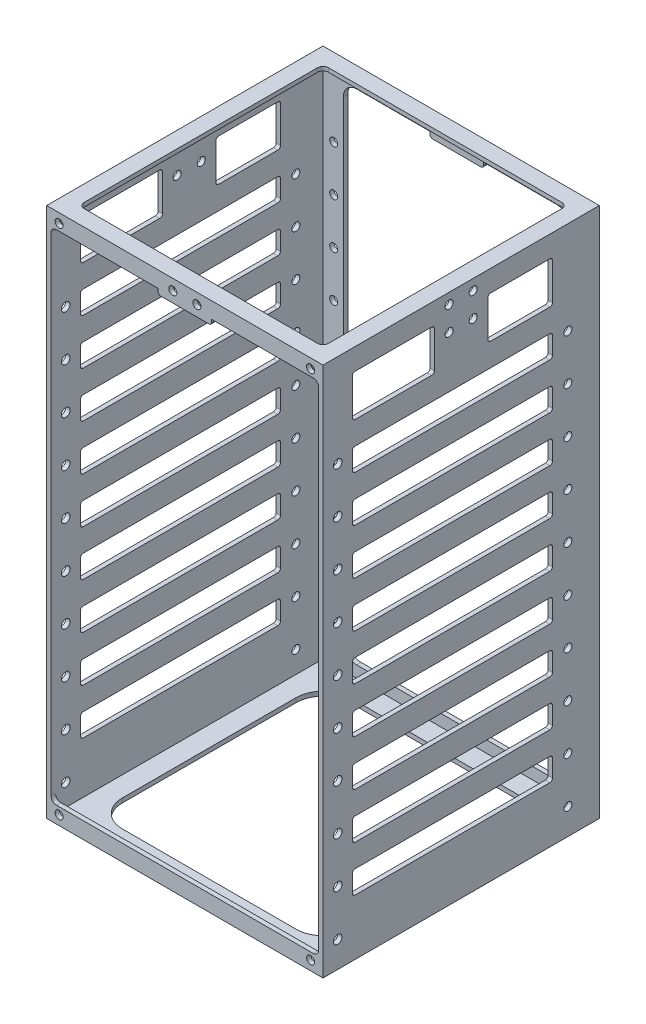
from build123d import *

# Parameters (mm, degrees)
SKETCH1_W           = 103.26
SKETCH1_H           = 103.26
BOSS_EXTRUDE2_DEPTH = 1.63
SKETCH3_W           = 103.26
SKETCH3_H           = 103.26
SKETCH3_W_2         = 100
SKETCH3_H_2         = 100
BOSS_EXTRUDE3_DEPTH = 196.74
CUT_EXTRUDE1_DEPTH  = 1.63
SKETCH6_R           = 1.6
SKETCH6_R_2         = 1.5
CUT_EXTRUDE2_DEPTH  = 230.518934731
CUT_EXTRUDE3_DEPTH  = 1.63
CUT_EXTRUDE4_DEPTH  = 230.518934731
CUT_EXTRUDE5_DEPTH  = 230.518934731
SKETCH15_W          = 20
SKETCH15_H          = 15.62
BOSS_EXTRUDE4_DEPTH = 1.63
SKETCH16_W          = 20
SKETCH16_H          = 15.62
BOSS_EXTRUDE5_DEPTH = 1.63
SKETCH9_R           = 1.5
CUT_EXTRUDE6_DEPTH  = 230.518934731
FILLET1_R           = 1
BOSS_EXTRUDE7_DEPTH = 1.63
BOSS_EXTRUDE6_START = -1.63
BOSS_EXTRUDE6_DEPTH = 1.63
SKETCH19_R          = 1.5
CUT_EXTRUDE7_DEPTH  = 230.518934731
SKETCH20_R          = 1.5
CUT_EXTRUDE8_DEPTH  = 1.63
SKETCH23_R          = 1.5
CUT_EXTRUDE10_DEPTH = 1.63
SKETCH25_W          = 100
SKETCH25_H          = 100
BOSS_EXTRUDE8_DEPTH = 1.5
CUT_EXTRUDE11_DEPTH = 1.5


with BuildPart() as part:
    # Sketch1 → Boss-Extrude2 (new body)
    with BuildSketch(Plane(origin=(0, 0, 0), x_dir=(1, 0, 0), z_dir=(0, 1, 0))):
        Rectangle(SKETCH1_W, SKETCH1_H)
        with BuildLine():
            Line((-32.5, -42.5), (32.5, -42.5))
            ThreePointArc((32.5, -42.5), (39.571067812, -39.571067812), (42.5, -32.5))
            Line((42.5, -32.5), (42.5, 32.5))
            ThreePointArc((42.5, 32.5), (39.571067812, 39.571067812), (32.5, 42.5))
            Line((32.5, 42.5), (-32.5, 42.5))
            ThreePointArc((-32.5, 42.5), (-39.571067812, 39.571067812), (-42.5, 32.5))
            Line((-42.5, 32.5), (-42.5, -32.5))
            ThreePointArc((-42.5, -32.5), (-39.571067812, -39.571067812), (-32.5, -42.5))
        make_face(mode=Mode.SUBTRACT)
    extrude(amount=BOSS_EXTRUDE2_DEPTH)

    # Sketch3 → Boss-Extrude3 (add)
    with BuildSketch(Plane(origin=(0, 1.63, 0), x_dir=(1, 0, 0), z_dir=(0, 1, 0))):
        Rectangle(SKETCH3_W, SKETCH3_H)
        Rectangle(SKETCH3_W_2, SKETCH3_H_2, mode=Mode.SUBTRACT)
    extrude(amount=BOSS_EXTRUDE3_DEPTH)

    # Sketch4 → Cut-Extrude1 (cut)
    with BuildSketch(Plane.XY.offset(-51.63)):
        with BuildLine():
            Line((-37.38, 6), (37.38, 6))
            ThreePointArc((37.38, 6), (40.915533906, 7.464466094), (42.38, 11))
            Line((42.38, 11), (42.38, 187.37))
            ThreePointArc((42.38, 187.37), (40.915533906, 190.905533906), (37.38, 192.37))
            Line((37.38, 192.37), (-37.38, 192.37))
            ThreePointArc((-37.38, 192.37), (-40.915533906, 190.905533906), (-42.38, 187.37))
            Line((-42.38, 187.37), (-42.38, 11))
            ThreePointArc((-42.38, 11), (-40.915533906, 7.464466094), (-37.38, 6))
        make_face()
    extrude(amount=CUT_EXTRUDE1_DEPTH, mode=Mode.SUBTRACT)

    # Sketch6 → Cut-Extrude2 (cut, through all)
    with BuildSketch(Plane(origin=(51.63, 0, 0), x_dir=(0, 0, -1), z_dir=(1, 0, 0))):
        with Locations((-46.13, 9.75)):
            Circle(SKETCH6_R)
        with Locations((39.87, 9.75)):
            Circle(SKETCH6_R_2)
        with Locations((-46.13, 26.85)):
            Circle(SKETCH6_R)
        with Locations((39.87, 26.85)):
            Circle(SKETCH6_R_2)
        with Locations((-46.13, 43.95)):
            Circle(SKETCH6_R)
        with Locations((39.87, 43.95)):
            Circle(SKETCH6_R_2)
        with Locations((-46.13, 61.05)):
            Circle(SKETCH6_R)
        with Locations((39.87, 61.05)):
            Circle(SKETCH6_R_2)
        with Locations((-46.13, 78.15)):
            Circle(SKETCH6_R)
        with Locations((39.87, 78.15)):
            Circle(SKETCH6_R_2)
        with Locations((-46.13, 95.25)):
            Circle(SKETCH6_R)
        with Locations((39.87, 95.25)):
            Circle(SKETCH6_R_2)
        with Locations((-46.13, 112.35)):
            Circle(SKETCH6_R)
        with Locations((39.87, 112.35)):
            Circle(SKETCH6_R_2)
        with Locations((-46.13, 129.45)):
            Circle(SKETCH6_R)
        with Locations((39.87, 129.45)):
            Circle(SKETCH6_R_2)
        with Locations((-46.13, 146.55)):
            Circle(SKETCH6_R)
        with Locations((39.87, 146.55)):
            Circle(SKETCH6_R_2)
        with Locations((-46.13, 163.65)):
            Circle(SKETCH6_R)
        with Locations((39.87, 163.65)):
            Circle(SKETCH6_R_2)
    extrude(amount=-CUT_EXTRUDE2_DEPTH, mode=Mode.SUBTRACT)

    # Sketch5 → Cut-Extrude3 (cut)
    with BuildSketch(Plane.XY.offset(51.63)):
        with BuildLine():
            Line((-48, 6.13), (48, 6.13))
            ThreePointArc((48, 6.13), (49.414213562, 6.715786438), (50, 8.13))
            Line((50, 8.13), (50, 190.37))
            ThreePointArc((50, 190.37), (49.414213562, 191.784213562), (48, 192.37))
            Line((48, 192.37), (-48, 192.37))
            ThreePointArc((-48, 192.37), (-49.414213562, 191.784213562), (-50, 190.37))
            Line((-50, 190.37), (-50, 8.13))
            ThreePointArc((-50, 8.13), (-49.414213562, 6.715786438), (-48, 6.13))
        make_face()
    extrude(amount=-CUT_EXTRUDE3_DEPTH, mode=Mode.SUBTRACT)

    # Sketch7 → Cut-Extrude4 (cut, through all)
    with BuildSketch(Plane(origin=(51.63, 0, 0), x_dir=(0, 0, -1), z_dir=(1, 0, 0))):
        with BuildLine():
            Line((-40.63, 38.95), (-40.63, 45.45))
            ThreePointArc((-40.63, 45.45), (-40.337106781, 46.157106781), (-39.63, 46.45))
            Line((-39.63, 46.45), (33.12, 46.45))
            ThreePointArc((33.12, 46.45), (33.827106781, 46.157106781), (34.12, 45.45))
            Line((34.12, 45.45), (34.12, 38.95))
            ThreePointArc((34.12, 38.95), (33.827106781, 38.242893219), (33.12, 37.95))
            Line((33.12, 37.95), (-39.63, 37.95))
            ThreePointArc((-39.63, 37.95), (-40.337106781, 38.242893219), (-40.63, 38.95))
        make_face()
        with BuildLine():
            Line((-39.63, 20.85), (33.12, 20.85))
            ThreePointArc((33.12, 20.85), (33.827106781, 21.142893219), (34.12, 21.85))
            Line((34.12, 21.85), (34.12, 28.35))
            ThreePointArc((34.12, 28.35), (33.827106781, 29.057106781), (33.12, 29.35))
            Line((33.12, 29.35), (-39.63, 29.35))
            ThreePointArc((-39.63, 29.35), (-40.337106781, 29.057106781), (-40.63, 28.35))
            Line((-40.63, 28.35), (-40.63, 21.85))
            ThreePointArc((-40.63, 21.85), (-40.337106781, 21.142893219), (-39.63, 20.85))
        make_face()
        with BuildLine():
            Line((-40.63, 158.65), (-40.63, 165.15))
            ThreePointArc((-40.63, 165.15), (-40.337106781, 165.857106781), (-39.63, 166.15))
            Line((-39.63, 166.15), (33.12, 166.15))
            ThreePointArc((33.12, 166.15), (33.827106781, 165.857106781), (34.12, 165.15))
            Line((34.12, 165.15), (34.12, 158.65))
            ThreePointArc((34.12, 158.65), (33.827106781, 157.942893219), (33.12, 157.65))
            Line((33.12, 157.65), (-39.63, 157.65))
            ThreePointArc((-39.63, 157.65), (-40.337106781, 157.942893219), (-40.63, 158.65))
        make_face()
        with BuildLine():
            Line((-40.63, 56.05), (-40.63, 62.55))
            ThreePointArc((-40.63, 62.55), (-40.337106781, 63.257106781), (-39.63, 63.55))
            Line((-39.63, 63.55), (33.12, 63.55))
            ThreePointArc((33.12, 63.55), (33.827106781, 63.257106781), (34.12, 62.55))
            Line((34.12, 62.55), (34.12, 56.05))
            ThreePointArc((34.12, 56.05), (33.827106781, 55.342893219), (33.12, 55.05))
            Line((33.12, 55.05), (-39.63, 55.05))
            ThreePointArc((-39.63, 55.05), (-40.337106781, 55.342893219), (-40.63, 56.05))
        make_face()
        with BuildLine():
            Line((-40.63, 73.15), (-40.63, 79.65))
            ThreePointArc((-40.63, 79.65), (-40.337106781, 80.357106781), (-39.63, 80.65))
            Line((-39.63, 80.65), (33.12, 80.65))
            ThreePointArc((33.12, 80.65), (33.827106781, 80.357106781), (34.12, 79.65))
            Line((34.12, 79.65), (34.12, 73.15))
            ThreePointArc((34.12, 73.15), (33.827106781, 72.442893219), (33.12, 72.15))
            Line((33.12, 72.15), (-39.63, 72.15))
            ThreePointArc((-39.63, 72.15), (-40.337106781, 72.442893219), (-40.63, 73.15))
        make_face()
        with BuildLine():
            Line((-40.63, 90.25), (-40.63, 96.75))
            ThreePointArc((-40.63, 96.75), (-40.337106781, 97.457106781), (-39.63, 97.75))
            Line((-39.63, 97.75), (33.12, 97.75))
            ThreePointArc((33.12, 97.75), (33.827106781, 97.457106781), (34.12, 96.75))
            Line((34.12, 96.75), (34.12, 90.25))
            ThreePointArc((34.12, 90.25), (33.827106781, 89.542893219), (33.12, 89.25))
            Line((33.12, 89.25), (-39.63, 89.25))
            ThreePointArc((-39.63, 89.25), (-40.337106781, 89.542893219), (-40.63, 90.25))
        make_face()
        with BuildLine():
            Line((-40.63, 107.35), (-40.63, 113.85))
            ThreePointArc((-40.63, 113.85), (-40.337106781, 114.557106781), (-39.63, 114.85))
            Line((-39.63, 114.85), (33.12, 114.85))
            ThreePointArc((33.12, 114.85), (33.827106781, 114.557106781), (34.12, 113.85))
            Line((34.12, 113.85), (34.12, 107.35))
            ThreePointArc((34.12, 107.35), (33.827106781, 106.642893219), (33.12, 106.35))
            Line((33.12, 106.35), (-39.63, 106.35))
            ThreePointArc((-39.63, 106.35), (-40.337106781, 106.642893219), (-40.63, 107.35))
        make_face()
        with BuildLine():
            Line((-40.63, 124.45), (-40.63, 130.95))
            ThreePointArc((-40.63, 130.95), (-40.337106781, 131.657106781), (-39.63, 131.95))
            Line((-39.63, 131.95), (33.12, 131.95))
            ThreePointArc((33.12, 131.95), (33.827106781, 131.657106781), (34.12, 130.95))
            Line((34.12, 130.95), (34.12, 124.45))
            ThreePointArc((34.12, 124.45), (33.827106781, 123.742893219), (33.12, 123.45))
            Line((33.12, 123.45), (-39.63, 123.45))
            ThreePointArc((-39.63, 123.45), (-40.337106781, 123.742893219), (-40.63, 124.45))
        make_face()
        with BuildLine():
            Line((-40.63, 141.55), (-40.63, 148.05))
            ThreePointArc((-40.63, 148.05), (-40.337106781, 148.757106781), (-39.63, 149.05))
            Line((-39.63, 149.05), (33.12, 149.05))
            ThreePointArc((33.12, 149.05), (33.827106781, 148.757106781), (34.12, 148.05))
            Line((34.12, 148.05), (34.12, 141.55))
            ThreePointArc((34.12, 141.55), (33.827106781, 140.842893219), (33.12, 140.55))
            Line((33.12, 140.55), (-39.63, 140.55))
            ThreePointArc((-39.63, 140.55), (-40.337106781, 140.842893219), (-40.63, 141.55))
        make_face()
    extrude(amount=-CUT_EXTRUDE4_DEPTH, mode=Mode.SUBTRACT)

    # Sketch8 → Cut-Extrude5 (cut, through all)
    with BuildSketch(Plane(origin=(51.63, 0, 0), x_dir=(0, 0, -1), z_dir=(1, 0, 0))):
        with BuildLine():
            Line((-39.63, 190.37), (33.12, 190.37))
            ThreePointArc((33.12, 190.37), (33.827106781, 190.077106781), (34.12, 189.37))
            Line((34.12, 189.37), (34.12, 175.75))
            ThreePointArc((34.12, 175.75), (33.827106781, 175.042893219), (33.12, 174.75))
            Line((33.12, 174.75), (-39.63, 174.75))
            ThreePointArc((-39.63, 174.75), (-40.337106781, 175.042893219), (-40.63, 175.75))
            Line((-40.63, 175.75), (-40.63, 189.37))
            ThreePointArc((-40.63, 189.37), (-40.337106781, 190.077106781), (-39.63, 190.37))
        make_face()
    extrude(amount=-CUT_EXTRUDE5_DEPTH, mode=Mode.SUBTRACT)

    # Sketch15 → Boss-Extrude4 (add)
    with BuildSketch(Plane(origin=(51.63, 0, 0), x_dir=(0, 0, -1), z_dir=(1, 0, 0))):
        with Locations((0, 182.56)):
            Rectangle(SKETCH15_W, SKETCH15_H)
    extrude(amount=-BOSS_EXTRUDE4_DEPTH)

    # Sketch16 → Boss-Extrude5 (add)
    with BuildSketch(Plane.ZY.offset(51.63)):
        with Locations((0, 182.56)):
            Rectangle(SKETCH16_W, SKETCH16_H)
    extrude(amount=-BOSS_EXTRUDE5_DEPTH)

    # Sketch9 → Cut-Extrude6 (cut, through all)
    with BuildSketch(Plane(origin=(51.63, 0, 0), x_dir=(0, 0, -1), z_dir=(1, 0, 0))):
        with Locations((-4.5, 194.37)):
            Circle(SKETCH9_R)
        with Locations((4.5, 194.37)):
            Circle(SKETCH9_R)
        with Locations(Location((4.5, 185.37, 0), (0, 0, 180))):
            Circle(SKETCH9_R)
        with Locations(Location((-4.5, 185.37, 0), (0, 0, 180))):
            Circle(SKETCH9_R)
    extrude(amount=-CUT_EXTRUDE6_DEPTH, mode=Mode.SUBTRACT)

    # Fillet1
    fillet1_edges = [part.edges().sort_by_distance(p)[0] for p in [
        (50.815, 174.75, -10),
        (50.815, 190.37, -10),
        (50.815, 190.37, 10),
        (50.815, 174.75, 10),
        (-50.815, 174.75, -10),
        (-50.815, 190.37, -10),
        (-50.815, 190.37, 10),
        (-50.815, 174.75, 10),
    ]]
    fillet(fillet1_edges, radius=FILLET1_R)

    # Sketch18 → Boss-Extrude7 (add)
    with BuildSketch(Plane(origin=(0, 0, -51.63), x_dir=(-1, 0, 0), z_dir=(0, 0, -1))):
        with BuildLine():
            Line((-10, 192.37), (10, 192.37))
            Line((10, 192.37), (10, 191.37))
            ThreePointArc((10, 191.37), (9.707106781, 190.662893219), (9, 190.37))
            Line((9, 190.37), (-9, 190.37))
            ThreePointArc((-9, 190.37), (-9.707106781, 190.662893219), (-10, 191.37))
            Line((-10, 191.37), (-10, 192.37))
        make_face()
    extrude(amount=-BOSS_EXTRUDE7_DEPTH)

    # Sketch17 → Boss-Extrude6 (add)
    with BuildSketch(Plane.XY.offset(51.63).offset(BOSS_EXTRUDE6_START)):
        with BuildLine():
            Line((-10, 192.37), (10, 192.37))
            Line((10, 192.37), (10, 191.37))
            ThreePointArc((10, 191.37), (9.707106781, 190.662893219), (9, 190.37))
            Line((9, 190.37), (-9, 190.37))
            ThreePointArc((-9, 190.37), (-9.707106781, 190.662893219), (-10, 191.37))
            Line((-10, 191.37), (-10, 192.37))
        make_face()
    extrude(amount=BOSS_EXTRUDE6_DEPTH)

    # Sketch19 → Cut-Extrude7 (cut, through all)
    with BuildSketch(Plane.XY.offset(51.63)):
        with Locations((-4.5, 194.37)):
            Circle(SKETCH19_R)
        with Locations(Location((4.5, 194.37, 0), (0, 0, 180))):
            Circle(SKETCH19_R)
    extrude(amount=-CUT_EXTRUDE7_DEPTH, mode=Mode.SUBTRACT)

    # Sketch20 → Cut-Extrude8 (cut)
    with BuildSketch(Plane.XY.offset(51.63)):
        with Locations((-46.98, 3.5)):
            Circle(SKETCH20_R)
        with Locations((-46.98, 194.87)):
            Circle(SKETCH20_R)
        with Locations(Location((46.98, 3.5, 0), (0, 0, 180))):
            Circle(SKETCH20_R)
        with Locations(Location((46.98, 194.87, 0), (0, 0, 180))):
            Circle(SKETCH20_R)
    extrude(amount=-CUT_EXTRUDE8_DEPTH, mode=Mode.SUBTRACT)

    # Sketch23 → Cut-Extrude10 (cut)
    with BuildSketch(Plane(origin=(0, 0, -51.63), x_dir=(-1, 0, 0), z_dir=(0, 0, -1))):
        with Locations((-46, 17.05)):
            Circle(SKETCH23_R)
        with Locations((-46, 34.15)):
            Circle(SKETCH23_R)
        with Locations((-46, 51.25)):
            Circle(SKETCH23_R)
        with Locations((-46, 68.35)):
            Circle(SKETCH23_R)
        with Locations((-46, 85.45)):
            Circle(SKETCH23_R)
        with Locations((-46, 102.55)):
            Circle(SKETCH23_R)
        with Locations((-46, 119.65)):
            Circle(SKETCH23_R)
        with Locations((-46, 136.75)):
            Circle(SKETCH23_R)
        with Locations((-46, 153.85)):
            Circle(SKETCH23_R)
        with Locations((-46, 170.95)):
            Circle(SKETCH23_R)
        with Locations((46, 170.95)):
            Circle(SKETCH23_R)
        with Locations((46, 153.85)):
            Circle(SKETCH23_R)
        with Locations((46, 136.75)):
            Circle(SKETCH23_R)
        with Locations((46, 119.65)):
            Circle(SKETCH23_R)
        with Locations((46, 102.55)):
            Circle(SKETCH23_R)
        with Locations((46, 85.45)):
            Circle(SKETCH23_R)
        with Locations((46, 68.35)):
            Circle(SKETCH23_R)
        with Locations((46, 51.25)):
            Circle(SKETCH23_R)
        with Locations((46, 34.15)):
            Circle(SKETCH23_R)
        with Locations((46, 17.05)):
            Circle(SKETCH23_R)
    extrude(amount=-CUT_EXTRUDE10_DEPTH, mode=Mode.SUBTRACT)

    # Sketch25 → Boss-Extrude8 (add)
    with BuildSketch(Plane(origin=(0, 198.37, 0), x_dir=(1, 0, 0), z_dir=(0, 1, 0))):
        Rectangle(SKETCH25_W, SKETCH25_H)
    extrude(amount=-BOSS_EXTRUDE8_DEPTH)

    # Sketch26 → Cut-Extrude11 (cut)
    with BuildSketch(Plane(origin=(0, 198.37, 0), x_dir=(1, 0, 0), z_dir=(0, 1, 0))):
        with BuildLine():
            Line((-43.63, -45.63), (43.63, -45.63))
            ThreePointArc((43.63, -45.63), (45.044213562, -45.044213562), (45.63, -43.63))
            Line((45.63, -43.63), (45.63, 43.63))
            ThreePointArc((45.63, 43.63), (45.044213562, 45.044213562), (43.63, 45.63))
            Line((43.63, 45.63), (-43.63, 45.63))
            ThreePointArc((-43.63, 45.63), (-45.044213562, 45.044213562), (-45.63, 43.63))
            Line((-45.63, 43.63), (-45.63, -43.63))
            ThreePointArc((-45.63, -43.63), (-45.044213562, -45.044213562), (-43.63, -45.63))
        make_face()
    extrude(amount=-CUT_EXTRUDE11_DEPTH, mode=Mode.SUBTRACT)


solid = part.part
